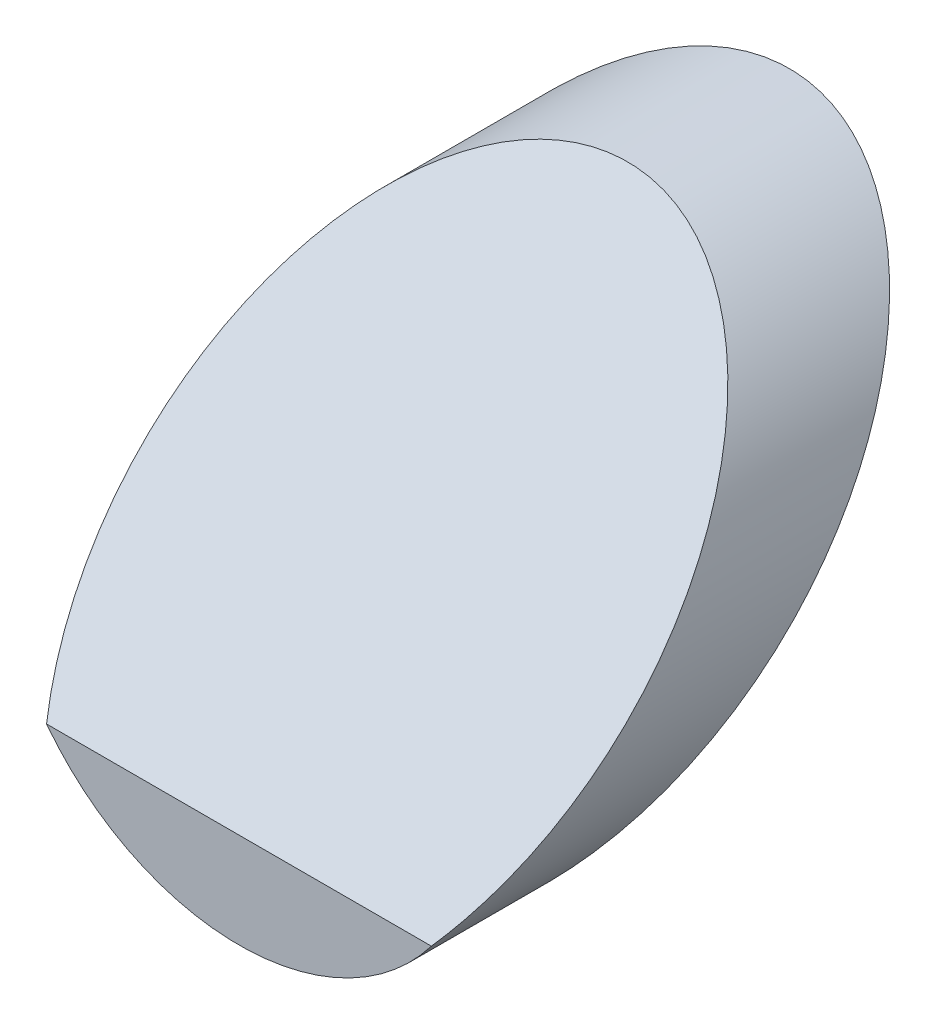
ISO-10303-21;
HEADER;
FILE_DESCRIPTION(('STEP AP214'),'2;1');
FILE_NAME('part.step','',(''),(''),'','','');
FILE_SCHEMA(('AUTOMOTIVE_DESIGN { 1 0 10303 214 1 1 1 1 }'));
ENDSEC;
DATA;
#1=APPLICATION_CONTEXT('core data for automotive mechanical design processes');
#2=APPLICATION_PROTOCOL_DEFINITION('international standard','automotive_design',2000,#1);
#3=PRODUCT_CONTEXT('',#1,'mechanical');
#4=PRODUCT('Part','Part','',(#3));
#5=PRODUCT_RELATED_PRODUCT_CATEGORY('part','',(#4));
#6=PRODUCT_DEFINITION_FORMATION('','',#4);
#7=PRODUCT_DEFINITION_CONTEXT('part definition',#1,'design');
#8=PRODUCT_DEFINITION('design','',#6,#7);
#9=PRODUCT_DEFINITION_SHAPE('','',#8);
#10=(LENGTH_UNIT() NAMED_UNIT(*) SI_UNIT(.MILLI.,.METRE.));
#11=(NAMED_UNIT(*) PLANE_ANGLE_UNIT() SI_UNIT($,.RADIAN.));
#12=(NAMED_UNIT(*) SI_UNIT($,.STERADIAN.) SOLID_ANGLE_UNIT());
#13=UNCERTAINTY_MEASURE_WITH_UNIT(LENGTH_MEASURE(1.E-05),#10,'distance_accuracy_value','');
#14=(GEOMETRIC_REPRESENTATION_CONTEXT(3) GLOBAL_UNCERTAINTY_ASSIGNED_CONTEXT((#13)) GLOBAL_UNIT_ASSIGNED_CONTEXT((#10,
#11,#12)) REPRESENTATION_CONTEXT('',''));
#15=CARTESIAN_POINT('',(0.,0.,0.));
#16=DIRECTION('',(0.,0.,1.));
#17=DIRECTION('',(1.,0.,0.));
#18=AXIS2_PLACEMENT_3D('',#15,#16,#17);
#19=CARTESIAN_POINT('',(0.,0.,-50.8));
#20=DIRECTION('',(0.,0.,1.));
#21=DIRECTION('',(1.,0.,0.));
#22=AXIS2_PLACEMENT_3D('',#19,#20,#21);
#23=CYLINDRICAL_SURFACE('',#22,25.4);
#24=CARTESIAN_POINT('',(0.,0.,-16.9705627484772));
#25=DIRECTION('',(0.,0.707106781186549,0.707106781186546));
#26=DIRECTION('',(0.,-0.707106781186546,0.707106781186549));
#27=AXIS2_PLACEMENT_3D('',#24,#25,#26);
#28=ELLIPSE('',#27,35.9210244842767,25.4);
#29=CARTESIAN_POINT('',(0.,-25.4,8.42943725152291));
#30=VERTEX_POINT('',#29);
#31=EDGE_CURVE('E50',#30,#30,#28,.F.);
#32=ORIENTED_EDGE('',*,*,#31,.F.);
#33=EDGE_LOOP('',(#32));
#34=FACE_BOUND('',#33,.T.);
#35=CARTESIAN_POINT('',(0.,0.,0.));
#36=DIRECTION('',(0.,-0.707106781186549,-0.707106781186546));
#37=DIRECTION('',(0.,-0.707106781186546,0.707106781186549));
#38=AXIS2_PLACEMENT_3D('',#35,#36,#37);
#39=ELLIPSE('',#38,35.9210244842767,25.4);
#40=CARTESIAN_POINT('',(20.1990098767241,-15.4,15.4000000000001));
#41=VERTEX_POINT('',#40);
#42=CARTESIAN_POINT('',(-20.1990098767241,-15.4,15.4000000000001));
#43=VERTEX_POINT('',#42);
#44=EDGE_CURVE('E60',#41,#43,#39,.F.);
#45=ORIENTED_EDGE('',*,*,#44,.F.);
#46=CARTESIAN_POINT('',(0.,0.,15.4000000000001));
#47=DIRECTION('',(0.,0.,1.));
#48=DIRECTION('',(1.,0.,0.));
#49=AXIS2_PLACEMENT_3D('',#46,#47,#48);
#50=CIRCLE('',#49,25.4);
#51=EDGE_CURVE('E55',#41,#43,#50,.F.);
#52=ORIENTED_EDGE('',*,*,#51,.T.);
#53=EDGE_LOOP('',(#45,#52));
#54=FACE_BOUND('',#53,.T.);
#55=ADVANCED_FACE('F43',(#34,#54),#23,.T.);
#56=CARTESIAN_POINT('',(76.2,0.,0.));
#57=DIRECTION('',(0.,-0.707106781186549,-0.707106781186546));
#58=DIRECTION('',(0.,0.707106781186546,-0.707106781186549));
#59=AXIS2_PLACEMENT_3D('',#56,#57,#58);
#60=PLANE('',#59);
#61=DIRECTION('',(-1.,0.,0.));
#62=VECTOR('',#61,1.);
#63=CARTESIAN_POINT('',(76.2,-15.4,15.4000000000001));
#64=LINE('',#63,#62);
#65=EDGE_CURVE('E12',#41,#43,#64,.T.);
#66=ORIENTED_EDGE('',*,*,#65,.F.);
#67=ORIENTED_EDGE('',*,*,#44,.T.);
#68=EDGE_LOOP('',(#66,#67));
#69=FACE_BOUND('',#68,.T.);
#70=ADVANCED_FACE('F64',(#69),#60,.F.);
#71=CARTESIAN_POINT('',(76.2,27.435743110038,-44.4063058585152));
#72=DIRECTION('',(0.,0.707106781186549,0.707106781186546));
#73=DIRECTION('',(0.,-0.707106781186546,0.707106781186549));
#74=AXIS2_PLACEMENT_3D('',#71,#72,#73);
#75=PLANE('',#74);
#76=ORIENTED_EDGE('',*,*,#31,.T.);
#77=EDGE_LOOP('',(#76));
#78=FACE_BOUND('',#77,.T.);
#79=ADVANCED_FACE('F69',(#78),#75,.F.);
#80=CARTESIAN_POINT('',(50.,-25.4,15.4000000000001));
#81=DIRECTION('',(0.,0.,1.));
#82=DIRECTION('',(1.,0.,0.));
#83=AXIS2_PLACEMENT_3D('',#80,#81,#82);
#84=PLANE('',#83);
#85=ORIENTED_EDGE('',*,*,#65,.T.);
#86=ORIENTED_EDGE('',*,*,#51,.F.);
#87=EDGE_LOOP('',(#85,#86));
#88=FACE_BOUND('',#87,.T.);
#89=ADVANCED_FACE('F62',(#88),#84,.T.);
#90=CLOSED_SHELL('',(#55,#70,#79,#89));
#91=MANIFOLD_SOLID_BREP('B2',#90);
#92=ADVANCED_BREP_SHAPE_REPRESENTATION('',(#18,#91),#14);
#93=SHAPE_DEFINITION_REPRESENTATION(#9,#92);
ENDSEC;
END-ISO-10303-21;
